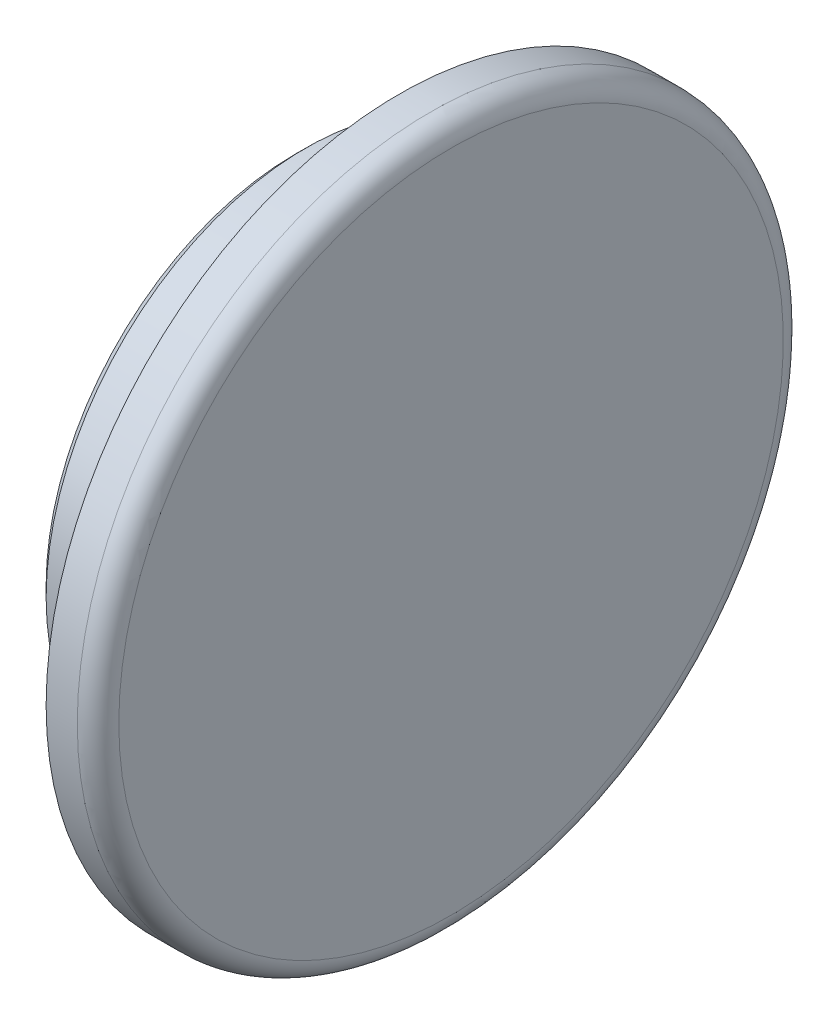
ISO-10303-21;
HEADER;
FILE_DESCRIPTION(('STEP AP214'),'2;1');
FILE_NAME('part.step','',(''),(''),'','','');
FILE_SCHEMA(('AUTOMOTIVE_DESIGN { 1 0 10303 214 1 1 1 1 }'));
ENDSEC;
DATA;
#1=APPLICATION_CONTEXT('core data for automotive mechanical design processes');
#2=APPLICATION_PROTOCOL_DEFINITION('international standard','automotive_design',2000,#1);
#3=PRODUCT_CONTEXT('',#1,'mechanical');
#4=PRODUCT('Part','Part','',(#3));
#5=PRODUCT_RELATED_PRODUCT_CATEGORY('part','',(#4));
#6=PRODUCT_DEFINITION_FORMATION('','',#4);
#7=PRODUCT_DEFINITION_CONTEXT('part definition',#1,'design');
#8=PRODUCT_DEFINITION('design','',#6,#7);
#9=PRODUCT_DEFINITION_SHAPE('','',#8);
#10=(LENGTH_UNIT() NAMED_UNIT(*) SI_UNIT(.MILLI.,.METRE.));
#11=(NAMED_UNIT(*) PLANE_ANGLE_UNIT() SI_UNIT($,.RADIAN.));
#12=(NAMED_UNIT(*) SI_UNIT($,.STERADIAN.) SOLID_ANGLE_UNIT());
#13=UNCERTAINTY_MEASURE_WITH_UNIT(LENGTH_MEASURE(1.E-05),#10,'distance_accuracy_value','');
#14=(GEOMETRIC_REPRESENTATION_CONTEXT(3) GLOBAL_UNCERTAINTY_ASSIGNED_CONTEXT((#13)) GLOBAL_UNIT_ASSIGNED_CONTEXT((#10,
#11,#12)) REPRESENTATION_CONTEXT('',''));
#15=CARTESIAN_POINT('',(0.,0.,0.));
#16=DIRECTION('',(0.,0.,1.));
#17=DIRECTION('',(1.,0.,0.));
#18=AXIS2_PLACEMENT_3D('',#15,#16,#17);
#19=CARTESIAN_POINT('',(0.,10.5,0.));
#20=DIRECTION('',(1.,0.,0.));
#21=DIRECTION('',(0.,0.,-1.));
#22=AXIS2_PLACEMENT_3D('',#19,#20,#21);
#23=PLANE('',#22);
#24=CARTESIAN_POINT('',(0.,0.,0.));
#25=DIRECTION('',(1.,0.,0.));
#26=DIRECTION('',(0.,0.,-1.));
#27=AXIS2_PLACEMENT_3D('',#24,#25,#26);
#28=CIRCLE('',#27,12.);
#29=CARTESIAN_POINT('',(0.,0.,-12.));
#30=VERTEX_POINT('',#29);
#31=EDGE_CURVE('E37',#30,#30,#28,.F.);
#32=ORIENTED_EDGE('',*,*,#31,.T.);
#33=EDGE_LOOP('',(#32));
#34=FACE_BOUND('',#33,.T.);
#35=CARTESIAN_POINT('',(0.,0.,0.));
#36=DIRECTION('',(-1.,0.,0.));
#37=DIRECTION('',(0.,0.,1.));
#38=AXIS2_PLACEMENT_3D('',#35,#36,#37);
#39=CIRCLE('',#38,10.5);
#40=CARTESIAN_POINT('',(0.,0.,10.5));
#41=VERTEX_POINT('',#40);
#42=EDGE_CURVE('E59',#41,#41,#39,.T.);
#43=ORIENTED_EDGE('',*,*,#42,.F.);
#44=EDGE_LOOP('',(#43));
#45=FACE_BOUND('',#44,.T.);
#46=ADVANCED_FACE('F30',(#34,#45),#23,.F.);
#47=CARTESIAN_POINT('',(-7.21543394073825,0.,0.));
#48=DIRECTION('',(-1.,0.,0.));
#49=DIRECTION('',(0.,0.,1.));
#50=AXIS2_PLACEMENT_3D('',#47,#48,#49);
#51=CYLINDRICAL_SURFACE('',#50,12.5);
#52=CARTESIAN_POINT('',(0.499999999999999,0.,0.));
#53=DIRECTION('',(1.,0.,0.));
#54=DIRECTION('',(0.,0.,-1.));
#55=AXIS2_PLACEMENT_3D('',#52,#53,#54);
#56=CIRCLE('',#55,12.5);
#57=CARTESIAN_POINT('',(0.499999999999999,0.,-12.5));
#58=VERTEX_POINT('',#57);
#59=EDGE_CURVE('E10',#58,#58,#56,.T.);
#60=ORIENTED_EDGE('',*,*,#59,.T.);
#61=EDGE_LOOP('',(#60));
#62=FACE_BOUND('',#61,.T.);
#63=CARTESIAN_POINT('',(5.,0.,0.));
#64=DIRECTION('',(-1.,0.,0.));
#65=DIRECTION('',(0.,0.,1.));
#66=AXIS2_PLACEMENT_3D('',#63,#64,#65);
#67=CIRCLE('',#66,12.5);
#68=CARTESIAN_POINT('',(5.,0.,12.5));
#69=VERTEX_POINT('',#68);
#70=EDGE_CURVE('E50',#69,#69,#67,.T.);
#71=ORIENTED_EDGE('',*,*,#70,.T.);
#72=EDGE_LOOP('',(#71));
#73=FACE_BOUND('',#72,.T.);
#74=ADVANCED_FACE('F66',(#62,#73),#51,.T.);
#75=CARTESIAN_POINT('',(5.,12.5,0.));
#76=DIRECTION('',(1.,0.,0.));
#77=DIRECTION('',(0.,0.,-1.));
#78=AXIS2_PLACEMENT_3D('',#75,#76,#77);
#79=PLANE('',#78);
#80=ORIENTED_EDGE('',*,*,#70,.F.);
#81=EDGE_LOOP('',(#80));
#82=FACE_BOUND('',#81,.T.);
#83=CARTESIAN_POINT('',(5.,0.,0.));
#84=DIRECTION('',(-1.,0.,0.));
#85=DIRECTION('',(0.,0.,1.));
#86=AXIS2_PLACEMENT_3D('',#83,#84,#85);
#87=CIRCLE('',#86,17.);
#88=CARTESIAN_POINT('',(5.,0.,17.));
#89=VERTEX_POINT('',#88);
#90=EDGE_CURVE('E53',#89,#89,#87,.T.);
#91=ORIENTED_EDGE('',*,*,#90,.T.);
#92=EDGE_LOOP('',(#91));
#93=FACE_BOUND('',#92,.T.);
#94=ADVANCED_FACE('F71',(#82,#93),#79,.F.);
#95=CARTESIAN_POINT('',(-7.21543394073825,0.,0.));
#96=DIRECTION('',(-1.,0.,0.));
#97=DIRECTION('',(0.,0.,1.));
#98=AXIS2_PLACEMENT_3D('',#95,#96,#97);
#99=CYLINDRICAL_SURFACE('',#98,17.);
#100=CARTESIAN_POINT('',(6.5,0.,0.));
#101=DIRECTION('',(-1.,0.,0.));
#102=DIRECTION('',(0.,0.,1.));
#103=AXIS2_PLACEMENT_3D('',#100,#101,#102);
#104=CIRCLE('',#103,17.);
#105=CARTESIAN_POINT('',(6.5,0.,17.));
#106=VERTEX_POINT('',#105);
#107=EDGE_CURVE('E45',#106,#106,#104,.T.);
#108=ORIENTED_EDGE('',*,*,#107,.T.);
#109=EDGE_LOOP('',(#108));
#110=FACE_BOUND('',#109,.T.);
#111=ORIENTED_EDGE('',*,*,#90,.F.);
#112=EDGE_LOOP('',(#111));
#113=FACE_BOUND('',#112,.T.);
#114=ADVANCED_FACE('F89',(#110,#113),#99,.T.);
#115=CARTESIAN_POINT('',(7.5,0.,0.));
#116=DIRECTION('',(-1.,0.,0.));
#117=DIRECTION('',(0.,0.,1.));
#118=AXIS2_PLACEMENT_3D('',#115,#116,#117);
#119=PLANE('',#118);
#120=CARTESIAN_POINT('',(7.5,0.,0.));
#121=DIRECTION('',(-1.,0.,0.));
#122=DIRECTION('',(0.,0.,1.));
#123=AXIS2_PLACEMENT_3D('',#120,#121,#122);
#124=CIRCLE('',#123,16.);
#125=CARTESIAN_POINT('',(7.5,0.,16.));
#126=VERTEX_POINT('',#125);
#127=EDGE_CURVE('E41',#126,#126,#124,.F.);
#128=ORIENTED_EDGE('',*,*,#127,.T.);
#129=EDGE_LOOP('',(#128));
#130=FACE_BOUND('',#129,.T.);
#131=ADVANCED_FACE('F92',(#130),#119,.F.);
#132=CARTESIAN_POINT('',(5.,10.5,0.));
#133=DIRECTION('',(1.,0.,0.));
#134=DIRECTION('',(0.,0.,-1.));
#135=AXIS2_PLACEMENT_3D('',#132,#133,#134);
#136=PLANE('',#135);
#137=CARTESIAN_POINT('',(5.,0.,0.));
#138=DIRECTION('',(-1.,0.,0.));
#139=DIRECTION('',(0.,0.,1.));
#140=AXIS2_PLACEMENT_3D('',#137,#138,#139);
#141=CIRCLE('',#140,10.5);
#142=CARTESIAN_POINT('',(5.,0.,10.5));
#143=VERTEX_POINT('',#142);
#144=EDGE_CURVE('E56',#143,#143,#141,.T.);
#145=ORIENTED_EDGE('',*,*,#144,.T.);
#146=EDGE_LOOP('',(#145));
#147=FACE_BOUND('',#146,.T.);
#148=ADVANCED_FACE('F82',(#147),#136,.F.);
#149=CARTESIAN_POINT('',(-7.21543394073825,0.,0.));
#150=DIRECTION('',(-1.,0.,0.));
#151=DIRECTION('',(0.,0.,1.));
#152=AXIS2_PLACEMENT_3D('',#149,#150,#151);
#153=CYLINDRICAL_SURFACE('',#152,10.5);
#154=ORIENTED_EDGE('',*,*,#144,.F.);
#155=EDGE_LOOP('',(#154));
#156=FACE_BOUND('',#155,.T.);
#157=ORIENTED_EDGE('',*,*,#42,.T.);
#158=EDGE_LOOP('',(#157));
#159=FACE_BOUND('',#158,.T.);
#160=ADVANCED_FACE('F63',(#156,#159),#153,.F.);
#161=CARTESIAN_POINT('',(6.5,0.,0.));
#162=DIRECTION('',(-1.,0.,0.));
#163=DIRECTION('',(0.,0.,1.));
#164=AXIS2_PLACEMENT_3D('',#161,#162,#163);
#165=TOROIDAL_SURFACE('',#164,16.,1.);
#166=ORIENTED_EDGE('',*,*,#127,.F.);
#167=EDGE_LOOP('',(#166));
#168=FACE_BOUND('',#167,.T.);
#169=ORIENTED_EDGE('',*,*,#107,.F.);
#170=EDGE_LOOP('',(#169));
#171=FACE_BOUND('',#170,.T.);
#172=ADVANCED_FACE('F74',(#168,#171),#165,.T.);
#173=CARTESIAN_POINT('',(0.,0.,0.));
#174=DIRECTION('',(1.,0.,0.));
#175=DIRECTION('',(0.,0.,-1.));
#176=AXIS2_PLACEMENT_3D('',#173,#174,#175);
#177=CONICAL_SURFACE('',#176,12.,0.785398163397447);
#178=ORIENTED_EDGE('',*,*,#59,.F.);
#179=EDGE_LOOP('',(#178));
#180=FACE_BOUND('',#179,.T.);
#181=ORIENTED_EDGE('',*,*,#31,.F.);
#182=EDGE_LOOP('',(#181));
#183=FACE_BOUND('',#182,.T.);
#184=ADVANCED_FACE('F32',(#180,#183),#177,.T.);
#185=CLOSED_SHELL('',(#46,#74,#94,#114,#131,#148,#160,#172,#184));
#186=MANIFOLD_SOLID_BREP('B2',#185);
#187=ADVANCED_BREP_SHAPE_REPRESENTATION('',(#18,#186),#14);
#188=SHAPE_DEFINITION_REPRESENTATION(#9,#187);
ENDSEC;
END-ISO-10303-21;
